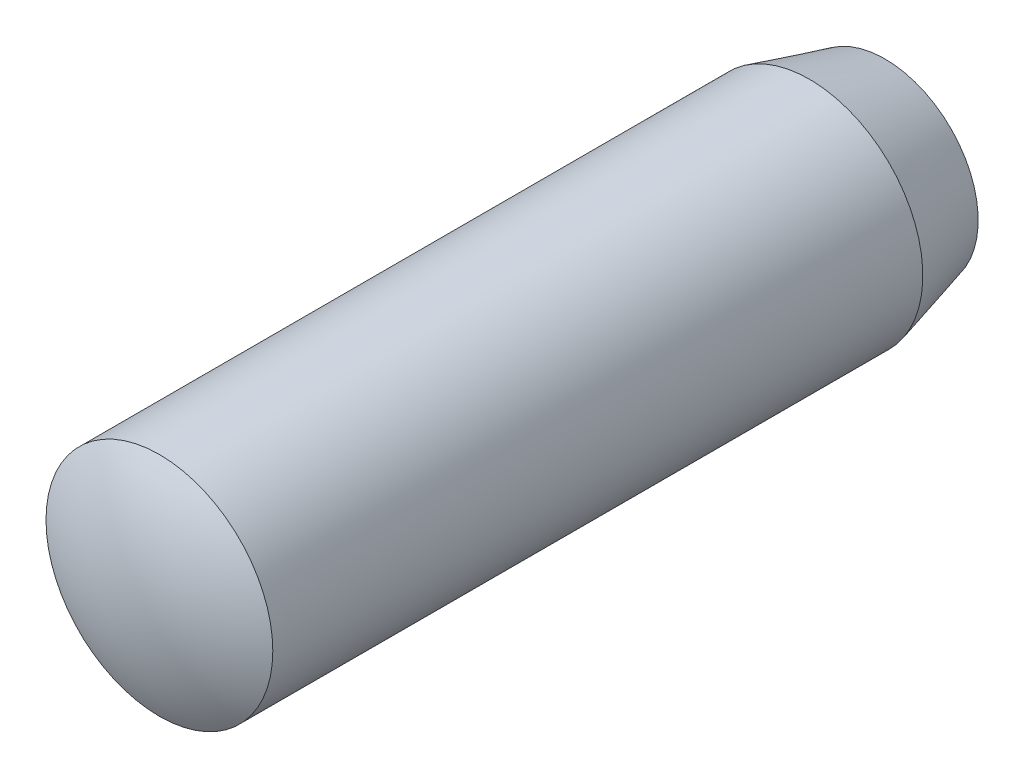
ISO-10303-21;
HEADER;
FILE_DESCRIPTION(('STEP AP214'),'2;1');
FILE_NAME('part.step','',(''),(''),'','','');
FILE_SCHEMA(('AUTOMOTIVE_DESIGN { 1 0 10303 214 1 1 1 1 }'));
ENDSEC;
DATA;
#1=APPLICATION_CONTEXT('core data for automotive mechanical design processes');
#2=APPLICATION_PROTOCOL_DEFINITION('international standard','automotive_design',2000,#1);
#3=PRODUCT_CONTEXT('',#1,'mechanical');
#4=PRODUCT('Part','Part','',(#3));
#5=PRODUCT_RELATED_PRODUCT_CATEGORY('part','',(#4));
#6=PRODUCT_DEFINITION_FORMATION('','',#4);
#7=PRODUCT_DEFINITION_CONTEXT('part definition',#1,'design');
#8=PRODUCT_DEFINITION('design','',#6,#7);
#9=PRODUCT_DEFINITION_SHAPE('','',#8);
#10=(LENGTH_UNIT() NAMED_UNIT(*) SI_UNIT(.MILLI.,.METRE.));
#11=(NAMED_UNIT(*) PLANE_ANGLE_UNIT() SI_UNIT($,.RADIAN.));
#12=(NAMED_UNIT(*) SI_UNIT($,.STERADIAN.) SOLID_ANGLE_UNIT());
#13=UNCERTAINTY_MEASURE_WITH_UNIT(LENGTH_MEASURE(1.E-05),#10,'distance_accuracy_value','');
#14=(GEOMETRIC_REPRESENTATION_CONTEXT(3) GLOBAL_UNCERTAINTY_ASSIGNED_CONTEXT((#13)) GLOBAL_UNIT_ASSIGNED_CONTEXT((#10,
#11,#12)) REPRESENTATION_CONTEXT('',''));
#15=CARTESIAN_POINT('',(0.,0.,0.));
#16=DIRECTION('',(0.,0.,1.));
#17=DIRECTION('',(1.,0.,0.));
#18=AXIS2_PLACEMENT_3D('',#15,#16,#17);
#19=CARTESIAN_POINT('',(70.,18.,4.));
#20=DIRECTION('',(0.,0.,1.));
#21=DIRECTION('',(1.,0.,0.));
#22=AXIS2_PLACEMENT_3D('',#19,#20,#21);
#23=SPHERICAL_SURFACE('',#22,6.);
#24=CARTESIAN_POINT('',(70.,18.,9.19615242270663));
#25=DIRECTION('',(0.,0.,1.));
#26=DIRECTION('',(-1.,0.,0.));
#27=AXIS2_PLACEMENT_3D('',#24,#25,#26);
#28=CIRCLE('',#27,3.);
#29=CARTESIAN_POINT('',(67.,18.,9.19615242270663));
#30=VERTEX_POINT('',#29);
#31=EDGE_CURVE('E8',#30,#30,#28,.T.);
#32=ORIENTED_EDGE('',*,*,#31,.T.);
#33=EDGE_LOOP('',(#32));
#34=FACE_BOUND('',#33,.T.);
#35=ADVANCED_FACE('F12',(#34),#23,.T.);
#36=CARTESIAN_POINT('',(70.,18.,20.));
#37=DIRECTION('',(0.,0.,1.));
#38=DIRECTION('',(-1.,0.,0.));
#39=AXIS2_PLACEMENT_3D('',#36,#37,#38);
#40=CYLINDRICAL_SURFACE('',#39,3.);
#41=ORIENTED_EDGE('',*,*,#31,.F.);
#42=EDGE_LOOP('',(#41));
#43=FACE_BOUND('',#42,.T.);
#44=CARTESIAN_POINT('',(70.,18.,-8.));
#45=DIRECTION('',(0.,0.,1.));
#46=DIRECTION('',(-1.,0.,0.));
#47=AXIS2_PLACEMENT_3D('',#44,#45,#46);
#48=CIRCLE('',#47,3.);
#49=CARTESIAN_POINT('',(67.,18.,-8.));
#50=VERTEX_POINT('',#49);
#51=EDGE_CURVE('E18',#50,#50,#48,.T.);
#52=ORIENTED_EDGE('',*,*,#51,.T.);
#53=EDGE_LOOP('',(#52));
#54=FACE_BOUND('',#53,.T.);
#55=ADVANCED_FACE('F38',(#43,#54),#40,.T.);
#56=CARTESIAN_POINT('',(70.,18.,-10.));
#57=DIRECTION('',(0.,0.,1.));
#58=DIRECTION('',(-1.,0.,0.));
#59=AXIS2_PLACEMENT_3D('',#56,#57,#58);
#60=CONICAL_SURFACE('',#59,2.46410161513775,0.26179938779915);
#61=ORIENTED_EDGE('',*,*,#51,.F.);
#62=EDGE_LOOP('',(#61));
#63=FACE_BOUND('',#62,.T.);
#64=CARTESIAN_POINT('',(70.,18.,-10.));
#65=DIRECTION('',(0.,0.,1.));
#66=DIRECTION('',(-1.,0.,0.));
#67=AXIS2_PLACEMENT_3D('',#64,#65,#66);
#68=CIRCLE('',#67,2.46410161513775);
#69=CARTESIAN_POINT('',(67.5358983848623,18.,-10.));
#70=VERTEX_POINT('',#69);
#71=EDGE_CURVE('E22',#70,#70,#68,.T.);
#72=ORIENTED_EDGE('',*,*,#71,.T.);
#73=EDGE_LOOP('',(#72));
#74=FACE_BOUND('',#73,.T.);
#75=ADVANCED_FACE('F29',(#63,#74),#60,.T.);
#76=CARTESIAN_POINT('',(70.,18.,-10.));
#77=DIRECTION('',(0.,0.,1.));
#78=DIRECTION('',(-1.,0.,0.));
#79=AXIS2_PLACEMENT_3D('',#76,#77,#78);
#80=PLANE('',#79);
#81=ORIENTED_EDGE('',*,*,#71,.F.);
#82=EDGE_LOOP('',(#81));
#83=FACE_BOUND('',#82,.T.);
#84=ADVANCED_FACE('F31',(#83),#80,.F.);
#85=CLOSED_SHELL('',(#35,#55,#75,#84));
#86=MANIFOLD_SOLID_BREP('B1',#85);
#87=ADVANCED_BREP_SHAPE_REPRESENTATION('',(#18,#86),#14);
#88=SHAPE_DEFINITION_REPRESENTATION(#9,#87);
ENDSEC;
END-ISO-10303-21;
